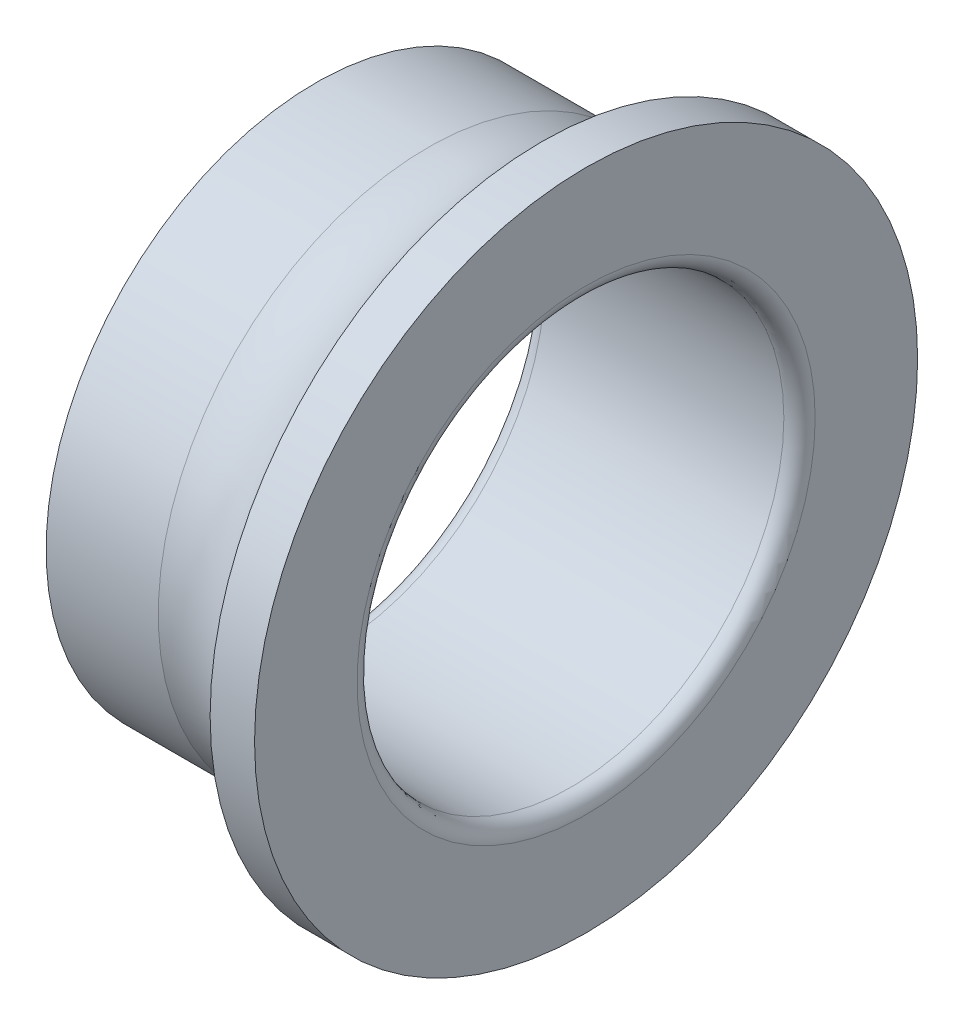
ISO-10303-21;
HEADER;
FILE_DESCRIPTION(('STEP AP214'),'2;1');
FILE_NAME('part.step','',(''),(''),'','','');
FILE_SCHEMA(('AUTOMOTIVE_DESIGN { 1 0 10303 214 1 1 1 1 }'));
ENDSEC;
DATA;
#1=APPLICATION_CONTEXT('core data for automotive mechanical design processes');
#2=APPLICATION_PROTOCOL_DEFINITION('international standard','automotive_design',2000,#1);
#3=PRODUCT_CONTEXT('',#1,'mechanical');
#4=PRODUCT('Part','Part','',(#3));
#5=PRODUCT_RELATED_PRODUCT_CATEGORY('part','',(#4));
#6=PRODUCT_DEFINITION_FORMATION('','',#4);
#7=PRODUCT_DEFINITION_CONTEXT('part definition',#1,'design');
#8=PRODUCT_DEFINITION('design','',#6,#7);
#9=PRODUCT_DEFINITION_SHAPE('','',#8);
#10=(LENGTH_UNIT() NAMED_UNIT(*) SI_UNIT(.MILLI.,.METRE.));
#11=(NAMED_UNIT(*) PLANE_ANGLE_UNIT() SI_UNIT($,.RADIAN.));
#12=(NAMED_UNIT(*) SI_UNIT($,.STERADIAN.) SOLID_ANGLE_UNIT());
#13=UNCERTAINTY_MEASURE_WITH_UNIT(LENGTH_MEASURE(1.E-05),#10,'distance_accuracy_value','');
#14=(GEOMETRIC_REPRESENTATION_CONTEXT(3) GLOBAL_UNCERTAINTY_ASSIGNED_CONTEXT((#13)) GLOBAL_UNIT_ASSIGNED_CONTEXT((#10,
#11,#12)) REPRESENTATION_CONTEXT('',''));
#15=CARTESIAN_POINT('',(0.,0.,0.));
#16=DIRECTION('',(0.,0.,1.));
#17=DIRECTION('',(1.,0.,0.));
#18=AXIS2_PLACEMENT_3D('',#15,#16,#17);
#19=CARTESIAN_POINT('',(1.10000000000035,0.,0.));
#20=DIRECTION('',(1.,0.,0.));
#21=DIRECTION('',(0.,0.,-1.));
#22=AXIS2_PLACEMENT_3D('',#19,#20,#21);
#23=TOROIDAL_SURFACE('',#22,16.1000000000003,1.10000000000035);
#24=CARTESIAN_POINT('',(1.1,0.,0.));
#25=DIRECTION('',(1.,0.,0.));
#26=DIRECTION('',(0.,0.,-1.));
#27=AXIS2_PLACEMENT_3D('',#24,#25,#26);
#28=CIRCLE('',#27,15.);
#29=CARTESIAN_POINT('',(1.1,0.,-15.));
#30=VERTEX_POINT('',#29);
#31=EDGE_CURVE('E10',#30,#30,#28,.T.);
#32=ORIENTED_EDGE('',*,*,#31,.T.);
#33=EDGE_LOOP('',(#32));
#34=FACE_BOUND('',#33,.T.);
#35=CARTESIAN_POINT('',(0.,0.,0.));
#36=DIRECTION('',(1.,0.,0.));
#37=DIRECTION('',(0.,0.,-1.));
#38=AXIS2_PLACEMENT_3D('',#35,#36,#37);
#39=CIRCLE('',#38,16.1);
#40=CARTESIAN_POINT('',(0.,0.,-16.1));
#41=VERTEX_POINT('',#40);
#42=EDGE_CURVE('E57',#41,#41,#39,.T.);
#43=ORIENTED_EDGE('',*,*,#42,.F.);
#44=EDGE_LOOP('',(#43));
#45=FACE_BOUND('',#44,.T.);
#46=ADVANCED_FACE('F29',(#34,#45),#23,.T.);
#47=CARTESIAN_POINT('',(19.,0.,0.));
#48=DIRECTION('',(1.,0.,0.));
#49=DIRECTION('',(0.,0.,-1.));
#50=AXIS2_PLACEMENT_3D('',#47,#48,#49);
#51=CYLINDRICAL_SURFACE('',#50,15.);
#52=CARTESIAN_POINT('',(17.9,0.,0.));
#53=DIRECTION('',(1.,0.,0.));
#54=DIRECTION('',(0.,0.,-1.));
#55=AXIS2_PLACEMENT_3D('',#52,#53,#54);
#56=CIRCLE('',#55,15.);
#57=CARTESIAN_POINT('',(17.9,0.,-15.));
#58=VERTEX_POINT('',#57);
#59=EDGE_CURVE('E35',#58,#58,#56,.T.);
#60=ORIENTED_EDGE('',*,*,#59,.T.);
#61=EDGE_LOOP('',(#60));
#62=FACE_BOUND('',#61,.T.);
#63=ORIENTED_EDGE('',*,*,#31,.F.);
#64=EDGE_LOOP('',(#63));
#65=FACE_BOUND('',#64,.T.);
#66=ADVANCED_FACE('F65',(#62,#65),#51,.F.);
#67=CARTESIAN_POINT('',(17.8999999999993,0.,0.));
#68=DIRECTION('',(1.,0.,0.));
#69=DIRECTION('',(0.,0.,-1.));
#70=AXIS2_PLACEMENT_3D('',#67,#68,#69);
#71=TOROIDAL_SURFACE('',#70,16.1000000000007,1.1000000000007);
#72=CARTESIAN_POINT('',(19.,0.,0.));
#73=DIRECTION('',(1.,0.,0.));
#74=DIRECTION('',(0.,0.,-1.));
#75=AXIS2_PLACEMENT_3D('',#72,#73,#74);
#76=CIRCLE('',#75,16.1);
#77=CARTESIAN_POINT('',(19.,0.,-16.1));
#78=VERTEX_POINT('',#77);
#79=EDGE_CURVE('E39',#78,#78,#76,.T.);
#80=ORIENTED_EDGE('',*,*,#79,.T.);
#81=EDGE_LOOP('',(#80));
#82=FACE_BOUND('',#81,.T.);
#83=ORIENTED_EDGE('',*,*,#59,.F.);
#84=EDGE_LOOP('',(#83));
#85=FACE_BOUND('',#84,.T.);
#86=ADVANCED_FACE('F69',(#82,#85),#71,.T.);
#87=CARTESIAN_POINT('',(19.,16.1,0.));
#88=DIRECTION('',(1.,0.,0.));
#89=DIRECTION('',(0.,0.,-1.));
#90=AXIS2_PLACEMENT_3D('',#87,#88,#89);
#91=PLANE('',#90);
#92=CARTESIAN_POINT('',(19.,0.,0.));
#93=DIRECTION('',(1.,0.,0.));
#94=DIRECTION('',(0.,0.,-1.));
#95=AXIS2_PLACEMENT_3D('',#92,#93,#94);
#96=CIRCLE('',#95,23.3);
#97=CARTESIAN_POINT('',(19.,0.,-23.3));
#98=VERTEX_POINT('',#97);
#99=EDGE_CURVE('E43',#98,#98,#96,.T.);
#100=ORIENTED_EDGE('',*,*,#99,.T.);
#101=EDGE_LOOP('',(#100));
#102=FACE_BOUND('',#101,.T.);
#103=ORIENTED_EDGE('',*,*,#79,.F.);
#104=EDGE_LOOP('',(#103));
#105=FACE_BOUND('',#104,.T.);
#106=ADVANCED_FACE('F73',(#102,#105),#91,.T.);
#107=CARTESIAN_POINT('',(19.,0.,0.));
#108=DIRECTION('',(1.,0.,0.));
#109=DIRECTION('',(0.,0.,-1.));
#110=AXIS2_PLACEMENT_3D('',#107,#108,#109);
#111=CYLINDRICAL_SURFACE('',#110,23.3);
#112=CARTESIAN_POINT('',(15.878244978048,0.,0.));
#113=DIRECTION('',(1.,0.,0.));
#114=DIRECTION('',(0.,0.,-1.));
#115=AXIS2_PLACEMENT_3D('',#112,#113,#114);
#116=CIRCLE('',#115,23.3);
#117=CARTESIAN_POINT('',(15.878244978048,0.,-23.3));
#118=VERTEX_POINT('',#117);
#119=EDGE_CURVE('E48',#118,#118,#116,.T.);
#120=ORIENTED_EDGE('',*,*,#119,.T.);
#121=EDGE_LOOP('',(#120));
#122=FACE_BOUND('',#121,.T.);
#123=ORIENTED_EDGE('',*,*,#99,.F.);
#124=EDGE_LOOP('',(#123));
#125=FACE_BOUND('',#124,.T.);
#126=ADVANCED_FACE('F80',(#122,#125),#111,.T.);
#127=CARTESIAN_POINT('',(9.49999999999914,0.,0.));
#128=DIRECTION('',(1.,0.,0.));
#129=DIRECTION('',(0.,0.,-1.));
#130=AXIS2_PLACEMENT_3D('',#127,#128,#129);
#131=TOROIDAL_SURFACE('',#130,25.500000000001,6.74700000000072);
#132=CARTESIAN_POINT('',(7.8815102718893,0.,0.));
#133=DIRECTION('',(1.,0.,0.));
#134=DIRECTION('',(0.,0.,-1.));
#135=AXIS2_PLACEMENT_3D('',#132,#133,#134);
#136=CIRCLE('',#135,18.95);
#137=CARTESIAN_POINT('',(7.8815102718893,0.,-18.95));
#138=VERTEX_POINT('',#137);
#139=EDGE_CURVE('E51',#138,#138,#136,.T.);
#140=ORIENTED_EDGE('',*,*,#139,.T.);
#141=EDGE_LOOP('',(#140));
#142=FACE_BOUND('',#141,.T.);
#143=ORIENTED_EDGE('',*,*,#119,.F.);
#144=EDGE_LOOP('',(#143));
#145=FACE_BOUND('',#144,.T.);
#146=ADVANCED_FACE('F84',(#142,#145),#131,.F.);
#147=CARTESIAN_POINT('',(19.,0.,0.));
#148=DIRECTION('',(1.,0.,0.));
#149=DIRECTION('',(0.,0.,-1.));
#150=AXIS2_PLACEMENT_3D('',#147,#148,#149);
#151=CYLINDRICAL_SURFACE('',#150,18.95);
#152=CARTESIAN_POINT('',(0.,0.,0.));
#153=DIRECTION('',(1.,0.,0.));
#154=DIRECTION('',(0.,0.,-1.));
#155=AXIS2_PLACEMENT_3D('',#152,#153,#154);
#156=CIRCLE('',#155,18.95);
#157=CARTESIAN_POINT('',(0.,0.,-18.95));
#158=VERTEX_POINT('',#157);
#159=EDGE_CURVE('E54',#158,#158,#156,.T.);
#160=ORIENTED_EDGE('',*,*,#159,.T.);
#161=EDGE_LOOP('',(#160));
#162=FACE_BOUND('',#161,.T.);
#163=ORIENTED_EDGE('',*,*,#139,.F.);
#164=EDGE_LOOP('',(#163));
#165=FACE_BOUND('',#164,.T.);
#166=ADVANCED_FACE('F88',(#162,#165),#151,.T.);
#167=CARTESIAN_POINT('',(0.,18.95,0.));
#168=DIRECTION('',(-1.,0.,0.));
#169=DIRECTION('',(0.,0.,1.));
#170=AXIS2_PLACEMENT_3D('',#167,#168,#169);
#171=PLANE('',#170);
#172=ORIENTED_EDGE('',*,*,#42,.T.);
#173=EDGE_LOOP('',(#172));
#174=FACE_BOUND('',#173,.T.);
#175=ORIENTED_EDGE('',*,*,#159,.F.);
#176=EDGE_LOOP('',(#175));
#177=FACE_BOUND('',#176,.T.);
#178=ADVANCED_FACE('F61',(#174,#177),#171,.T.);
#179=CLOSED_SHELL('',(#46,#66,#86,#106,#126,#146,#166,#178));
#180=MANIFOLD_SOLID_BREP('B2',#179);
#181=ADVANCED_BREP_SHAPE_REPRESENTATION('',(#18,#180),#14);
#182=SHAPE_DEFINITION_REPRESENTATION(#9,#181);
ENDSEC;
END-ISO-10303-21;
